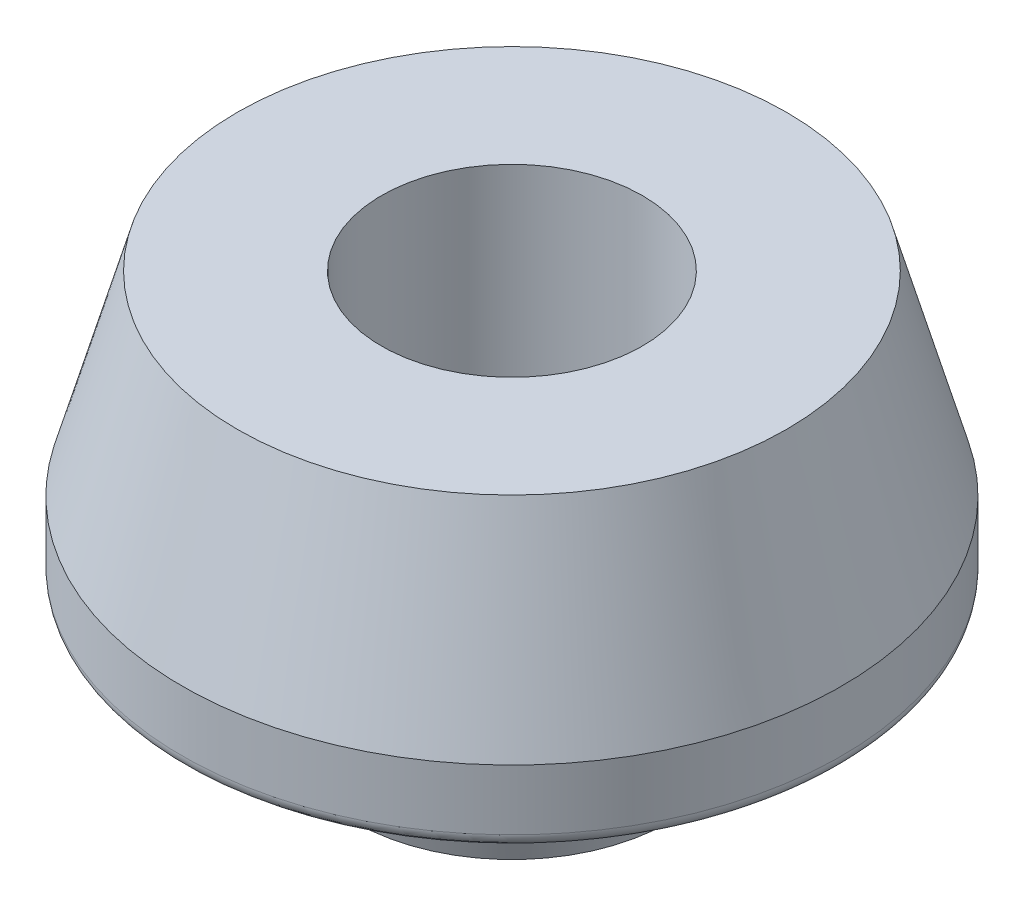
ISO-10303-21;
HEADER;
FILE_DESCRIPTION(('STEP AP214'),'2;1');
FILE_NAME('part.step','',(''),(''),'','','');
FILE_SCHEMA(('AUTOMOTIVE_DESIGN { 1 0 10303 214 1 1 1 1 }'));
ENDSEC;
DATA;
#1=APPLICATION_CONTEXT('core data for automotive mechanical design processes');
#2=APPLICATION_PROTOCOL_DEFINITION('international standard','automotive_design',2000,#1);
#3=PRODUCT_CONTEXT('',#1,'mechanical');
#4=PRODUCT('Part','Part','',(#3));
#5=PRODUCT_RELATED_PRODUCT_CATEGORY('part','',(#4));
#6=PRODUCT_DEFINITION_FORMATION('','',#4);
#7=PRODUCT_DEFINITION_CONTEXT('part definition',#1,'design');
#8=PRODUCT_DEFINITION('design','',#6,#7);
#9=PRODUCT_DEFINITION_SHAPE('','',#8);
#10=(LENGTH_UNIT() NAMED_UNIT(*) SI_UNIT(.MILLI.,.METRE.));
#11=(NAMED_UNIT(*) PLANE_ANGLE_UNIT() SI_UNIT($,.RADIAN.));
#12=(NAMED_UNIT(*) SI_UNIT($,.STERADIAN.) SOLID_ANGLE_UNIT());
#13=UNCERTAINTY_MEASURE_WITH_UNIT(LENGTH_MEASURE(1.E-05),#10,'distance_accuracy_value','');
#14=(GEOMETRIC_REPRESENTATION_CONTEXT(3) GLOBAL_UNCERTAINTY_ASSIGNED_CONTEXT((#13)) GLOBAL_UNIT_ASSIGNED_CONTEXT((#10,
#11,#12)) REPRESENTATION_CONTEXT('',''));
#15=CARTESIAN_POINT('',(0.,0.,0.));
#16=DIRECTION('',(0.,0.,1.));
#17=DIRECTION('',(1.,0.,0.));
#18=AXIS2_PLACEMENT_3D('',#15,#16,#17);
#19=CARTESIAN_POINT('',(0.,-14.5,0.));
#20=DIRECTION('',(0.,-1.,0.));
#21=DIRECTION('',(0.,0.,-1.));
#22=AXIS2_PLACEMENT_3D('',#19,#20,#21);
#23=CYLINDRICAL_SURFACE('',#22,4.75);
#24=CARTESIAN_POINT('',(0.,-14.5,0.));
#25=DIRECTION('',(0.,-1.,0.));
#26=DIRECTION('',(0.,0.,-1.));
#27=AXIS2_PLACEMENT_3D('',#24,#25,#26);
#28=CIRCLE('',#27,4.75);
#29=CARTESIAN_POINT('',(0.,-14.5,-4.75));
#30=VERTEX_POINT('',#29);
#31=EDGE_CURVE('E39',#30,#30,#28,.T.);
#32=ORIENTED_EDGE('',*,*,#31,.T.);
#33=EDGE_LOOP('',(#32));
#34=FACE_BOUND('',#33,.T.);
#35=CARTESIAN_POINT('',(0.,0.,0.));
#36=DIRECTION('',(0.,-1.,0.));
#37=DIRECTION('',(0.,0.,-1.));
#38=AXIS2_PLACEMENT_3D('',#35,#36,#37);
#39=CIRCLE('',#38,4.75);
#40=CARTESIAN_POINT('',(0.,0.,-4.75));
#41=VERTEX_POINT('',#40);
#42=EDGE_CURVE('E57',#41,#41,#39,.T.);
#43=ORIENTED_EDGE('',*,*,#42,.F.);
#44=EDGE_LOOP('',(#43));
#45=FACE_BOUND('',#44,.T.);
#46=ADVANCED_FACE('F28',(#34,#45),#23,.F.);
#47=CARTESIAN_POINT('',(4.75,-14.5,0.));
#48=DIRECTION('',(0.,-1.,0.));
#49=DIRECTION('',(0.,0.,-1.));
#50=AXIS2_PLACEMENT_3D('',#47,#48,#49);
#51=PLANE('',#50);
#52=CARTESIAN_POINT('',(0.,-14.5,0.));
#53=DIRECTION('',(0.,-1.,0.));
#54=DIRECTION('',(0.,0.,-1.));
#55=AXIS2_PLACEMENT_3D('',#52,#53,#54);
#56=CIRCLE('',#55,5.75);
#57=CARTESIAN_POINT('',(0.,-14.5,-5.75));
#58=VERTEX_POINT('',#57);
#59=EDGE_CURVE('E43',#58,#58,#56,.T.);
#60=ORIENTED_EDGE('',*,*,#59,.T.);
#61=EDGE_LOOP('',(#60));
#62=FACE_BOUND('',#61,.T.);
#63=ORIENTED_EDGE('',*,*,#31,.F.);
#64=EDGE_LOOP('',(#63));
#65=FACE_BOUND('',#64,.T.);
#66=ADVANCED_FACE('F65',(#62,#65),#51,.T.);
#67=CARTESIAN_POINT('',(0.,-14.5,0.));
#68=DIRECTION('',(0.,1.,0.));
#69=DIRECTION('',(0.,0.,1.));
#70=AXIS2_PLACEMENT_3D('',#67,#68,#69);
#71=CONICAL_SURFACE('',#70,5.75,0.259940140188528);
#72=CARTESIAN_POINT('',(0.,-9.8,0.));
#73=DIRECTION('',(0.,-1.,0.));
#74=DIRECTION('',(0.,0.,-1.));
#75=AXIS2_PLACEMENT_3D('',#72,#73,#74);
#76=CIRCLE('',#75,7.);
#77=CARTESIAN_POINT('',(0.,-9.8,-7.));
#78=VERTEX_POINT('',#77);
#79=EDGE_CURVE('E48',#78,#78,#76,.T.);
#80=ORIENTED_EDGE('',*,*,#79,.T.);
#81=EDGE_LOOP('',(#80));
#82=FACE_BOUND('',#81,.T.);
#83=ORIENTED_EDGE('',*,*,#59,.F.);
#84=EDGE_LOOP('',(#83));
#85=FACE_BOUND('',#84,.T.);
#86=ADVANCED_FACE('F70',(#82,#85),#71,.T.);
#87=CARTESIAN_POINT('',(7.,-9.8,0.));
#88=DIRECTION('',(0.,-1.,0.));
#89=DIRECTION('',(0.,0.,-1.));
#90=AXIS2_PLACEMENT_3D('',#87,#88,#89);
#91=PLANE('',#90);
#92=CARTESIAN_POINT('',(0.,-9.8,0.));
#93=DIRECTION('',(0.,-1.,0.));
#94=DIRECTION('',(0.,0.,-1.));
#95=AXIS2_PLACEMENT_3D('',#92,#93,#94);
#96=CIRCLE('',#95,11.5);
#97=CARTESIAN_POINT('',(0.,-9.8,-11.5));
#98=VERTEX_POINT('',#97);
#99=EDGE_CURVE('E35',#98,#98,#96,.T.);
#100=ORIENTED_EDGE('',*,*,#99,.T.);
#101=EDGE_LOOP('',(#100));
#102=FACE_BOUND('',#101,.T.);
#103=ORIENTED_EDGE('',*,*,#79,.F.);
#104=EDGE_LOOP('',(#103));
#105=FACE_BOUND('',#104,.T.);
#106=ADVANCED_FACE('F76',(#102,#105),#91,.T.);
#107=CARTESIAN_POINT('',(0.,-14.5,0.));
#108=DIRECTION('',(0.,-1.,0.));
#109=DIRECTION('',(0.,0.,-1.));
#110=AXIS2_PLACEMENT_3D('',#107,#108,#109);
#111=CYLINDRICAL_SURFACE('',#110,12.);
#112=CARTESIAN_POINT('',(0.,-9.3,0.));
#113=DIRECTION('',(0.,-1.,0.));
#114=DIRECTION('',(0.,0.,-1.));
#115=AXIS2_PLACEMENT_3D('',#112,#113,#114);
#116=CIRCLE('',#115,12.);
#117=CARTESIAN_POINT('',(0.,-9.3,-12.));
#118=VERTEX_POINT('',#117);
#119=EDGE_CURVE('E10',#118,#118,#116,.F.);
#120=ORIENTED_EDGE('',*,*,#119,.T.);
#121=EDGE_LOOP('',(#120));
#122=FACE_BOUND('',#121,.T.);
#123=CARTESIAN_POINT('',(0.,-7.1,0.));
#124=DIRECTION('',(0.,-1.,0.));
#125=DIRECTION('',(0.,0.,-1.));
#126=AXIS2_PLACEMENT_3D('',#123,#124,#125);
#127=CIRCLE('',#126,12.);
#128=CARTESIAN_POINT('',(0.,-7.1,-12.));
#129=VERTEX_POINT('',#128);
#130=EDGE_CURVE('E51',#129,#129,#127,.T.);
#131=ORIENTED_EDGE('',*,*,#130,.T.);
#132=EDGE_LOOP('',(#131));
#133=FACE_BOUND('',#132,.T.);
#134=ADVANCED_FACE('F80',(#122,#133),#111,.T.);
#135=CARTESIAN_POINT('',(0.,-7.1,0.));
#136=DIRECTION('',(0.,-1.,0.));
#137=DIRECTION('',(0.,0.,-1.));
#138=AXIS2_PLACEMENT_3D('',#135,#136,#137);
#139=CONICAL_SURFACE('',#138,12.,0.274575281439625);
#140=CARTESIAN_POINT('',(0.,0.,0.));
#141=DIRECTION('',(0.,-1.,0.));
#142=DIRECTION('',(0.,0.,-1.));
#143=AXIS2_PLACEMENT_3D('',#140,#141,#142);
#144=CIRCLE('',#143,10.);
#145=CARTESIAN_POINT('',(0.,0.,-10.));
#146=VERTEX_POINT('',#145);
#147=EDGE_CURVE('E54',#146,#146,#144,.T.);
#148=ORIENTED_EDGE('',*,*,#147,.T.);
#149=EDGE_LOOP('',(#148));
#150=FACE_BOUND('',#149,.T.);
#151=ORIENTED_EDGE('',*,*,#130,.F.);
#152=EDGE_LOOP('',(#151));
#153=FACE_BOUND('',#152,.T.);
#154=ADVANCED_FACE('F83',(#150,#153),#139,.T.);
#155=CARTESIAN_POINT('',(10.,0.,0.));
#156=DIRECTION('',(0.,1.,0.));
#157=DIRECTION('',(0.,0.,1.));
#158=AXIS2_PLACEMENT_3D('',#155,#156,#157);
#159=PLANE('',#158);
#160=ORIENTED_EDGE('',*,*,#42,.T.);
#161=EDGE_LOOP('',(#160));
#162=FACE_BOUND('',#161,.T.);
#163=ORIENTED_EDGE('',*,*,#147,.F.);
#164=EDGE_LOOP('',(#163));
#165=FACE_BOUND('',#164,.T.);
#166=ADVANCED_FACE('F61',(#162,#165),#159,.T.);
#167=CARTESIAN_POINT('',(0.,-9.3,0.));
#168=DIRECTION('',(0.,-1.,0.));
#169=DIRECTION('',(0.,0.,-1.));
#170=AXIS2_PLACEMENT_3D('',#167,#168,#169);
#171=TOROIDAL_SURFACE('',#170,11.5,0.5);
#172=ORIENTED_EDGE('',*,*,#119,.F.);
#173=EDGE_LOOP('',(#172));
#174=FACE_BOUND('',#173,.T.);
#175=ORIENTED_EDGE('',*,*,#99,.F.);
#176=EDGE_LOOP('',(#175));
#177=FACE_BOUND('',#176,.T.);
#178=ADVANCED_FACE('F30',(#174,#177),#171,.T.);
#179=CLOSED_SHELL('',(#46,#66,#86,#106,#134,#154,#166,#178));
#180=MANIFOLD_SOLID_BREP('B2',#179);
#181=ADVANCED_BREP_SHAPE_REPRESENTATION('',(#18,#180),#14);
#182=SHAPE_DEFINITION_REPRESENTATION(#9,#181);
ENDSEC;
END-ISO-10303-21;
